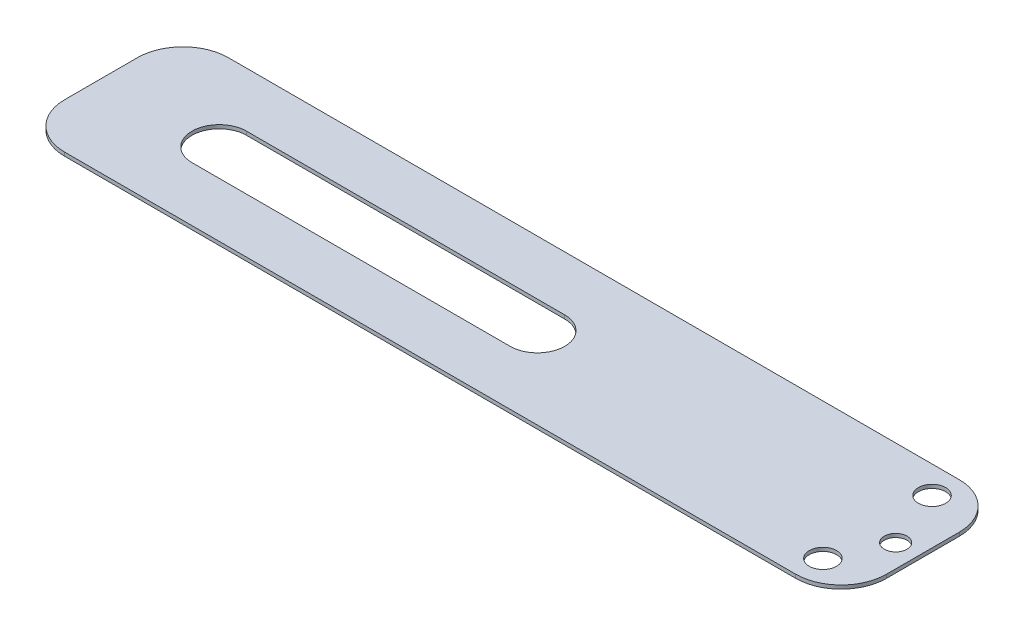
ISO-10303-21;
HEADER;
FILE_DESCRIPTION(('STEP AP214'),'2;1');
FILE_NAME('part.step','',(''),(''),'','','');
FILE_SCHEMA(('AUTOMOTIVE_DESIGN { 1 0 10303 214 1 1 1 1 }'));
ENDSEC;
DATA;
#1=APPLICATION_CONTEXT('core data for automotive mechanical design processes');
#2=APPLICATION_PROTOCOL_DEFINITION('international standard','automotive_design',2000,#1);
#3=PRODUCT_CONTEXT('',#1,'mechanical');
#4=PRODUCT('Part','Part','',(#3));
#5=PRODUCT_RELATED_PRODUCT_CATEGORY('part','',(#4));
#6=PRODUCT_DEFINITION_FORMATION('','',#4);
#7=PRODUCT_DEFINITION_CONTEXT('part definition',#1,'design');
#8=PRODUCT_DEFINITION('design','',#6,#7);
#9=PRODUCT_DEFINITION_SHAPE('','',#8);
#10=(LENGTH_UNIT() NAMED_UNIT(*) SI_UNIT(.MILLI.,.METRE.));
#11=(NAMED_UNIT(*) PLANE_ANGLE_UNIT() SI_UNIT($,.RADIAN.));
#12=(NAMED_UNIT(*) SI_UNIT($,.STERADIAN.) SOLID_ANGLE_UNIT());
#13=UNCERTAINTY_MEASURE_WITH_UNIT(LENGTH_MEASURE(1.E-05),#10,'distance_accuracy_value','');
#14=(GEOMETRIC_REPRESENTATION_CONTEXT(3) GLOBAL_UNCERTAINTY_ASSIGNED_CONTEXT((#13)) GLOBAL_UNIT_ASSIGNED_CONTEXT((#10,
#11,#12)) REPRESENTATION_CONTEXT('',''));
#15=CARTESIAN_POINT('',(0.,0.,0.));
#16=DIRECTION('',(0.,0.,1.));
#17=DIRECTION('',(1.,0.,0.));
#18=AXIS2_PLACEMENT_3D('',#15,#16,#17);
#19=CARTESIAN_POINT('',(-5.,0.4,13.));
#20=DIRECTION('',(0.,-1.,0.));
#21=DIRECTION('',(0.,0.,-1.));
#22=AXIS2_PLACEMENT_3D('',#19,#20,#21);
#23=CYLINDRICAL_SURFACE('',#22,5.);
#24=DIRECTION('',(0.,-1.,0.));
#25=VECTOR('',#24,1.);
#26=CARTESIAN_POINT('',(0.,0.4,13.));
#27=LINE('',#26,#25);
#28=CARTESIAN_POINT('',(0.,0.4,13.));
#29=VERTEX_POINT('',#28);
#30=CARTESIAN_POINT('',(0.,0.,13.));
#31=VERTEX_POINT('',#30);
#32=EDGE_CURVE('E231',#29,#31,#27,.T.);
#33=ORIENTED_EDGE('',*,*,#32,.F.);
#34=CARTESIAN_POINT('',(-5.,0.4,13.));
#35=DIRECTION('',(0.,-1.,0.));
#36=DIRECTION('',(0.,0.,-1.));
#37=AXIS2_PLACEMENT_3D('',#34,#35,#36);
#38=CIRCLE('',#37,5.);
#39=CARTESIAN_POINT('',(-5.00000000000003,0.4,18.));
#40=VERTEX_POINT('',#39);
#41=EDGE_CURVE('E40',#40,#29,#38,.F.);
#42=ORIENTED_EDGE('',*,*,#41,.F.);
#43=DIRECTION('',(0.,-1.,0.));
#44=VECTOR('',#43,1.);
#45=CARTESIAN_POINT('',(-5.,0.4,18.));
#46=LINE('',#45,#44);
#47=CARTESIAN_POINT('',(-5.00000000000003,0.,18.));
#48=VERTEX_POINT('',#47);
#49=EDGE_CURVE('E234',#48,#40,#46,.F.);
#50=ORIENTED_EDGE('',*,*,#49,.F.);
#51=CARTESIAN_POINT('',(-5.,0.,13.));
#52=DIRECTION('',(0.,-1.,0.));
#53=DIRECTION('',(0.,0.,-1.));
#54=AXIS2_PLACEMENT_3D('',#51,#52,#53);
#55=CIRCLE('',#54,5.);
#56=EDGE_CURVE('E11',#31,#48,#55,.T.);
#57=ORIENTED_EDGE('',*,*,#56,.F.);
#58=EDGE_LOOP('',(#33,#42,#50,#57));
#59=FACE_BOUND('',#58,.T.);
#60=ADVANCED_FACE('F33',(#59),#23,.T.);
#61=CARTESIAN_POINT('',(-5.,0.4,5.));
#62=DIRECTION('',(0.,1.,0.));
#63=DIRECTION('',(0.,0.,1.));
#64=AXIS2_PLACEMENT_3D('',#61,#62,#63);
#65=CYLINDRICAL_SURFACE('',#64,5.);
#66=DIRECTION('',(0.,1.,0.));
#67=VECTOR('',#66,1.);
#68=CARTESIAN_POINT('',(0.,0.4,5.));
#69=LINE('',#68,#67);
#70=CARTESIAN_POINT('',(0.,0.,5.));
#71=VERTEX_POINT('',#70);
#72=CARTESIAN_POINT('',(0.,0.4,5.));
#73=VERTEX_POINT('',#72);
#74=EDGE_CURVE('E220',#71,#73,#69,.T.);
#75=ORIENTED_EDGE('',*,*,#74,.F.);
#76=CARTESIAN_POINT('',(-5.,0.,5.));
#77=DIRECTION('',(0.,-1.,0.));
#78=DIRECTION('',(0.,0.,-1.));
#79=AXIS2_PLACEMENT_3D('',#76,#77,#78);
#80=CIRCLE('',#79,5.);
#81=CARTESIAN_POINT('',(-5.00000000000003,0.,0.));
#82=VERTEX_POINT('',#81);
#83=EDGE_CURVE('E226',#82,#71,#80,.T.);
#84=ORIENTED_EDGE('',*,*,#83,.F.);
#85=DIRECTION('',(0.,1.,0.));
#86=VECTOR('',#85,1.);
#87=CARTESIAN_POINT('',(-5.,0.4,0.));
#88=LINE('',#87,#86);
#89=CARTESIAN_POINT('',(-5.00000000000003,0.4,0.));
#90=VERTEX_POINT('',#89);
#91=EDGE_CURVE('E223',#90,#82,#88,.F.);
#92=ORIENTED_EDGE('',*,*,#91,.F.);
#93=CARTESIAN_POINT('',(-5.,0.4,5.));
#94=DIRECTION('',(0.,-1.,0.));
#95=DIRECTION('',(0.,0.,-1.));
#96=AXIS2_PLACEMENT_3D('',#93,#94,#95);
#97=CIRCLE('',#96,5.);
#98=EDGE_CURVE('E229',#73,#90,#97,.F.);
#99=ORIENTED_EDGE('',*,*,#98,.F.);
#100=EDGE_LOOP('',(#75,#84,#92,#99));
#101=FACE_BOUND('',#100,.T.);
#102=ADVANCED_FACE('F244',(#101),#65,.T.);
#103=CARTESIAN_POINT('',(-90.4,0.4,18.));
#104=DIRECTION('',(1.,0.,0.));
#105=DIRECTION('',(0.,0.,-1.));
#106=AXIS2_PLACEMENT_3D('',#103,#104,#105);
#107=PLANE('',#106);
#108=DIRECTION('',(0.,0.,1.));
#109=VECTOR('',#108,1.);
#110=CARTESIAN_POINT('',(-90.4,0.4,18.));
#111=LINE('',#110,#109);
#112=CARTESIAN_POINT('',(-90.4,0.4,5.));
#113=VERTEX_POINT('',#112);
#114=CARTESIAN_POINT('',(-90.4,0.4,13.));
#115=VERTEX_POINT('',#114);
#116=EDGE_CURVE('E181',#113,#115,#111,.T.);
#117=ORIENTED_EDGE('',*,*,#116,.F.);
#118=DIRECTION('',(0.,-1.,0.));
#119=VECTOR('',#118,1.);
#120=CARTESIAN_POINT('',(-90.4,0.4,5.));
#121=LINE('',#120,#119);
#122=CARTESIAN_POINT('',(-90.4,0.,5.));
#123=VERTEX_POINT('',#122);
#124=EDGE_CURVE('E202',#113,#123,#121,.T.);
#125=ORIENTED_EDGE('',*,*,#124,.T.);
#126=DIRECTION('',(0.,0.,1.));
#127=VECTOR('',#126,1.);
#128=CARTESIAN_POINT('',(-90.4,0.,18.));
#129=LINE('',#128,#127);
#130=CARTESIAN_POINT('',(-90.4,0.,13.));
#131=VERTEX_POINT('',#130);
#132=EDGE_CURVE('E178',#123,#131,#129,.T.);
#133=ORIENTED_EDGE('',*,*,#132,.T.);
#134=DIRECTION('',(0.,-1.,0.));
#135=VECTOR('',#134,1.);
#136=CARTESIAN_POINT('',(-90.4,0.4,13.));
#137=LINE('',#136,#135);
#138=EDGE_CURVE('E192',#131,#115,#137,.F.);
#139=ORIENTED_EDGE('',*,*,#138,.T.);
#140=EDGE_LOOP('',(#117,#125,#133,#139));
#141=FACE_BOUND('',#140,.T.);
#142=ADVANCED_FACE('F258',(#141),#107,.F.);
#143=CARTESIAN_POINT('',(-90.4,0.4,18.));
#144=DIRECTION('',(0.,0.,-1.));
#145=DIRECTION('',(-1.,0.,0.));
#146=AXIS2_PLACEMENT_3D('',#143,#144,#145);
#147=PLANE('',#146);
#148=DIRECTION('',(1.,0.,0.));
#149=VECTOR('',#148,1.);
#150=CARTESIAN_POINT('',(-90.4,0.,18.));
#151=LINE('',#150,#149);
#152=CARTESIAN_POINT('',(-85.4,0.,18.));
#153=VERTEX_POINT('',#152);
#154=EDGE_CURVE('E195',#153,#48,#151,.T.);
#155=ORIENTED_EDGE('',*,*,#154,.T.);
#156=ORIENTED_EDGE('',*,*,#49,.T.);
#157=DIRECTION('',(1.,0.,0.));
#158=VECTOR('',#157,1.);
#159=CARTESIAN_POINT('',(-90.4,0.4,18.));
#160=LINE('',#159,#158);
#161=CARTESIAN_POINT('',(-85.4,0.4,18.));
#162=VERTEX_POINT('',#161);
#163=EDGE_CURVE('E184',#162,#40,#160,.T.);
#164=ORIENTED_EDGE('',*,*,#163,.F.);
#165=DIRECTION('',(0.,-1.,0.));
#166=VECTOR('',#165,1.);
#167=CARTESIAN_POINT('',(-85.4,0.4,18.));
#168=LINE('',#167,#166);
#169=EDGE_CURVE('E217',#162,#153,#168,.T.);
#170=ORIENTED_EDGE('',*,*,#169,.T.);
#171=EDGE_LOOP('',(#155,#156,#164,#170));
#172=FACE_BOUND('',#171,.T.);
#173=ADVANCED_FACE('F265',(#172),#147,.F.);
#174=CARTESIAN_POINT('',(0.,0.4,18.));
#175=DIRECTION('',(-1.,0.,0.));
#176=DIRECTION('',(0.,0.,1.));
#177=AXIS2_PLACEMENT_3D('',#174,#175,#176);
#178=PLANE('',#177);
#179=DIRECTION('',(0.,0.,-1.));
#180=VECTOR('',#179,1.);
#181=CARTESIAN_POINT('',(0.,0.4,18.));
#182=LINE('',#181,#180);
#183=EDGE_CURVE('E188',#29,#73,#182,.T.);
#184=ORIENTED_EDGE('',*,*,#183,.F.);
#185=ORIENTED_EDGE('',*,*,#32,.T.);
#186=DIRECTION('',(0.,0.,-1.));
#187=VECTOR('',#186,1.);
#188=CARTESIAN_POINT('',(0.,0.,18.));
#189=LINE('',#188,#187);
#190=EDGE_CURVE('E198',#31,#71,#189,.T.);
#191=ORIENTED_EDGE('',*,*,#190,.T.);
#192=ORIENTED_EDGE('',*,*,#74,.T.);
#193=EDGE_LOOP('',(#184,#185,#191,#192));
#194=FACE_BOUND('',#193,.T.);
#195=ADVANCED_FACE('F241',(#194),#178,.F.);
#196=CARTESIAN_POINT('',(-90.4,0.4,0.));
#197=DIRECTION('',(0.,0.,1.));
#198=DIRECTION('',(1.,0.,0.));
#199=AXIS2_PLACEMENT_3D('',#196,#197,#198);
#200=PLANE('',#199);
#201=DIRECTION('',(-1.,0.,0.));
#202=VECTOR('',#201,1.);
#203=CARTESIAN_POINT('',(-90.4,0.4,0.));
#204=LINE('',#203,#202);
#205=CARTESIAN_POINT('',(-85.4,0.4,0.));
#206=VERTEX_POINT('',#205);
#207=EDGE_CURVE('E190',#90,#206,#204,.T.);
#208=ORIENTED_EDGE('',*,*,#207,.F.);
#209=ORIENTED_EDGE('',*,*,#91,.T.);
#210=DIRECTION('',(-1.,0.,0.));
#211=VECTOR('',#210,1.);
#212=CARTESIAN_POINT('',(-90.4,0.,0.));
#213=LINE('',#212,#211);
#214=CARTESIAN_POINT('',(-85.4,0.,0.));
#215=VERTEX_POINT('',#214);
#216=EDGE_CURVE('E185',#82,#215,#213,.T.);
#217=ORIENTED_EDGE('',*,*,#216,.T.);
#218=DIRECTION('',(0.,-1.,0.));
#219=VECTOR('',#218,1.);
#220=CARTESIAN_POINT('',(-85.4,0.4,0.));
#221=LINE('',#220,#219);
#222=EDGE_CURVE('E210',#215,#206,#221,.F.);
#223=ORIENTED_EDGE('',*,*,#222,.T.);
#224=EDGE_LOOP('',(#208,#209,#217,#223));
#225=FACE_BOUND('',#224,.T.);
#226=ADVANCED_FACE('F251',(#225),#200,.F.);
#227=CARTESIAN_POINT('',(0.,0.4,0.));
#228=DIRECTION('',(0.,-1.,0.));
#229=DIRECTION('',(0.,0.,-1.));
#230=AXIS2_PLACEMENT_3D('',#227,#228,#229);
#231=PLANE('',#230);
#232=DIRECTION('',(1.,0.,0.));
#233=VECTOR('',#232,1.);
#234=CARTESIAN_POINT('',(-77.4,0.4,12.));
#235=LINE('',#234,#233);
#236=CARTESIAN_POINT('',(-77.4,0.4,12.));
#237=VERTEX_POINT('',#236);
#238=CARTESIAN_POINT('',(-42.4,0.4,12.));
#239=VERTEX_POINT('',#238);
#240=EDGE_CURVE('E153',#237,#239,#235,.T.);
#241=ORIENTED_EDGE('',*,*,#240,.F.);
#242=CARTESIAN_POINT('',(-77.4,0.4,9.));
#243=DIRECTION('',(0.,1.,0.));
#244=DIRECTION('',(0.,0.,1.));
#245=AXIS2_PLACEMENT_3D('',#242,#243,#244);
#246=CIRCLE('',#245,3.);
#247=CARTESIAN_POINT('',(-77.4,0.4,6.));
#248=VERTEX_POINT('',#247);
#249=EDGE_CURVE('E126',#248,#237,#246,.T.);
#250=ORIENTED_EDGE('',*,*,#249,.F.);
#251=DIRECTION('',(-1.,0.,0.));
#252=VECTOR('',#251,1.);
#253=CARTESIAN_POINT('',(-77.4,0.4,6.));
#254=LINE('',#253,#252);
#255=CARTESIAN_POINT('',(-42.4,0.4,6.));
#256=VERTEX_POINT('',#255);
#257=EDGE_CURVE('E144',#256,#248,#254,.T.);
#258=ORIENTED_EDGE('',*,*,#257,.F.);
#259=CARTESIAN_POINT('',(-42.4,0.4,9.));
#260=DIRECTION('',(0.,1.,0.));
#261=DIRECTION('',(0.,0.,1.));
#262=AXIS2_PLACEMENT_3D('',#259,#260,#261);
#263=CIRCLE('',#262,3.);
#264=EDGE_CURVE('E147',#239,#256,#263,.T.);
#265=ORIENTED_EDGE('',*,*,#264,.F.);
#266=EDGE_LOOP('',(#241,#250,#258,#265));
#267=FACE_BOUND('',#266,.T.);
#268=CARTESIAN_POINT('',(-2.5,0.4,9.5));
#269=DIRECTION('',(0.,1.,0.));
#270=DIRECTION('',(0.,0.,1.));
#271=AXIS2_PLACEMENT_3D('',#268,#269,#270);
#272=CIRCLE('',#271,1.25);
#273=CARTESIAN_POINT('',(-2.5,0.4,10.75));
#274=VERTEX_POINT('',#273);
#275=EDGE_CURVE('E159',#274,#274,#272,.T.);
#276=ORIENTED_EDGE('',*,*,#275,.F.);
#277=EDGE_LOOP('',(#276));
#278=FACE_BOUND('',#277,.T.);
#279=CARTESIAN_POINT('',(-5.,0.4,15.));
#280=DIRECTION('',(0.,1.,0.));
#281=DIRECTION('',(0.,0.,1.));
#282=AXIS2_PLACEMENT_3D('',#279,#280,#281);
#283=CIRCLE('',#282,1.5);
#284=CARTESIAN_POINT('',(-5.,0.4,16.5));
#285=VERTEX_POINT('',#284);
#286=EDGE_CURVE('E166',#285,#285,#283,.T.);
#287=ORIENTED_EDGE('',*,*,#286,.F.);
#288=EDGE_LOOP('',(#287));
#289=FACE_BOUND('',#288,.T.);
#290=CARTESIAN_POINT('',(-5.,0.4,3.));
#291=DIRECTION('',(0.,1.,0.));
#292=DIRECTION('',(0.,0.,1.));
#293=AXIS2_PLACEMENT_3D('',#290,#291,#292);
#294=CIRCLE('',#293,1.5);
#295=CARTESIAN_POINT('',(-5.,0.4,4.5));
#296=VERTEX_POINT('',#295);
#297=EDGE_CURVE('E172',#296,#296,#294,.T.);
#298=ORIENTED_EDGE('',*,*,#297,.F.);
#299=EDGE_LOOP('',(#298));
#300=FACE_BOUND('',#299,.T.);
#301=ORIENTED_EDGE('',*,*,#163,.T.);
#302=ORIENTED_EDGE('',*,*,#41,.T.);
#303=ORIENTED_EDGE('',*,*,#183,.T.);
#304=ORIENTED_EDGE('',*,*,#98,.T.);
#305=ORIENTED_EDGE('',*,*,#207,.T.);
#306=CARTESIAN_POINT('',(-85.4,0.4,5.));
#307=DIRECTION('',(0.,-1.,0.));
#308=DIRECTION('',(0.,0.,-1.));
#309=AXIS2_PLACEMENT_3D('',#306,#307,#308);
#310=CIRCLE('',#309,5.);
#311=EDGE_CURVE('E215',#206,#113,#310,.F.);
#312=ORIENTED_EDGE('',*,*,#311,.T.);
#313=ORIENTED_EDGE('',*,*,#116,.T.);
#314=CARTESIAN_POINT('',(-85.4,0.4,13.));
#315=DIRECTION('',(0.,-1.,0.));
#316=DIRECTION('',(0.,0.,-1.));
#317=AXIS2_PLACEMENT_3D('',#314,#315,#316);
#318=CIRCLE('',#317,5.);
#319=EDGE_CURVE('E213',#115,#162,#318,.F.);
#320=ORIENTED_EDGE('',*,*,#319,.T.);
#321=EDGE_LOOP('',(#301,#302,#303,#304,#305,#312,#313,#320));
#322=FACE_BOUND('',#321,.T.);
#323=ADVANCED_FACE('F236',(#267,#278,#289,#300,#322),#231,.F.);
#324=CARTESIAN_POINT('',(0.,0.,0.));
#325=DIRECTION('',(0.,-1.,0.));
#326=DIRECTION('',(0.,0.,-1.));
#327=AXIS2_PLACEMENT_3D('',#324,#325,#326);
#328=PLANE('',#327);
#329=CARTESIAN_POINT('',(-77.4,0.,9.));
#330=DIRECTION('',(0.,1.,0.));
#331=DIRECTION('',(0.,0.,1.));
#332=AXIS2_PLACEMENT_3D('',#329,#330,#331);
#333=CIRCLE('',#332,3.);
#334=CARTESIAN_POINT('',(-77.4,0.,6.));
#335=VERTEX_POINT('',#334);
#336=CARTESIAN_POINT('',(-77.4,0.,12.));
#337=VERTEX_POINT('',#336);
#338=EDGE_CURVE('E123',#335,#337,#333,.T.);
#339=ORIENTED_EDGE('',*,*,#338,.T.);
#340=DIRECTION('',(1.,0.,0.));
#341=VECTOR('',#340,1.);
#342=CARTESIAN_POINT('',(-77.4,0.,12.));
#343=LINE('',#342,#341);
#344=CARTESIAN_POINT('',(-42.4,0.,12.));
#345=VERTEX_POINT('',#344);
#346=EDGE_CURVE('E135',#337,#345,#343,.T.);
#347=ORIENTED_EDGE('',*,*,#346,.T.);
#348=CARTESIAN_POINT('',(-42.4,0.,9.));
#349=DIRECTION('',(0.,1.,0.));
#350=DIRECTION('',(0.,0.,1.));
#351=AXIS2_PLACEMENT_3D('',#348,#349,#350);
#352=CIRCLE('',#351,3.);
#353=CARTESIAN_POINT('',(-42.4,0.,6.));
#354=VERTEX_POINT('',#353);
#355=EDGE_CURVE('E139',#345,#354,#352,.T.);
#356=ORIENTED_EDGE('',*,*,#355,.T.);
#357=DIRECTION('',(-1.,0.,0.));
#358=VECTOR('',#357,1.);
#359=CARTESIAN_POINT('',(-77.4,0.,6.));
#360=LINE('',#359,#358);
#361=EDGE_CURVE('E131',#354,#335,#360,.T.);
#362=ORIENTED_EDGE('',*,*,#361,.T.);
#363=EDGE_LOOP('',(#339,#347,#356,#362));
#364=FACE_BOUND('',#363,.T.);
#365=CARTESIAN_POINT('',(-2.5,0.,9.5));
#366=DIRECTION('',(0.,1.,0.));
#367=DIRECTION('',(0.,0.,1.));
#368=AXIS2_PLACEMENT_3D('',#365,#366,#367);
#369=CIRCLE('',#368,1.25);
#370=CARTESIAN_POINT('',(-2.5,0.,10.75));
#371=VERTEX_POINT('',#370);
#372=EDGE_CURVE('E163',#371,#371,#369,.T.);
#373=ORIENTED_EDGE('',*,*,#372,.T.);
#374=EDGE_LOOP('',(#373));
#375=FACE_BOUND('',#374,.T.);
#376=CARTESIAN_POINT('',(-5.,0.,15.));
#377=DIRECTION('',(0.,1.,0.));
#378=DIRECTION('',(0.,0.,1.));
#379=AXIS2_PLACEMENT_3D('',#376,#377,#378);
#380=CIRCLE('',#379,1.5);
#381=CARTESIAN_POINT('',(-5.,0.,16.5));
#382=VERTEX_POINT('',#381);
#383=EDGE_CURVE('E169',#382,#382,#380,.T.);
#384=ORIENTED_EDGE('',*,*,#383,.T.);
#385=EDGE_LOOP('',(#384));
#386=FACE_BOUND('',#385,.T.);
#387=CARTESIAN_POINT('',(-5.,0.,3.));
#388=DIRECTION('',(0.,1.,0.));
#389=DIRECTION('',(0.,0.,1.));
#390=AXIS2_PLACEMENT_3D('',#387,#388,#389);
#391=CIRCLE('',#390,1.5);
#392=CARTESIAN_POINT('',(-5.,0.,4.5));
#393=VERTEX_POINT('',#392);
#394=EDGE_CURVE('E175',#393,#393,#391,.T.);
#395=ORIENTED_EDGE('',*,*,#394,.T.);
#396=EDGE_LOOP('',(#395));
#397=FACE_BOUND('',#396,.T.);
#398=ORIENTED_EDGE('',*,*,#190,.F.);
#399=ORIENTED_EDGE('',*,*,#56,.T.);
#400=ORIENTED_EDGE('',*,*,#154,.F.);
#401=CARTESIAN_POINT('',(-85.4,0.,13.));
#402=DIRECTION('',(0.,-1.,0.));
#403=DIRECTION('',(0.,0.,-1.));
#404=AXIS2_PLACEMENT_3D('',#401,#402,#403);
#405=CIRCLE('',#404,5.);
#406=EDGE_CURVE('E205',#153,#131,#405,.T.);
#407=ORIENTED_EDGE('',*,*,#406,.T.);
#408=ORIENTED_EDGE('',*,*,#132,.F.);
#409=CARTESIAN_POINT('',(-85.4,0.,5.));
#410=DIRECTION('',(0.,-1.,0.));
#411=DIRECTION('',(0.,0.,-1.));
#412=AXIS2_PLACEMENT_3D('',#409,#410,#411);
#413=CIRCLE('',#412,5.);
#414=EDGE_CURVE('E207',#123,#215,#413,.T.);
#415=ORIENTED_EDGE('',*,*,#414,.T.);
#416=ORIENTED_EDGE('',*,*,#216,.F.);
#417=ORIENTED_EDGE('',*,*,#83,.T.);
#418=EDGE_LOOP('',(#398,#399,#400,#407,#408,#415,#416,#417));
#419=FACE_BOUND('',#418,.T.);
#420=ADVANCED_FACE('F141',(#364,#375,#386,#397,#419),#328,.T.);
#421=CARTESIAN_POINT('',(-5.,0.,3.));
#422=DIRECTION('',(0.,1.,0.));
#423=DIRECTION('',(0.,0.,1.));
#424=AXIS2_PLACEMENT_3D('',#421,#422,#423);
#425=CYLINDRICAL_SURFACE('',#424,1.5);
#426=ORIENTED_EDGE('',*,*,#394,.F.);
#427=EDGE_LOOP('',(#426));
#428=FACE_BOUND('',#427,.T.);
#429=ORIENTED_EDGE('',*,*,#297,.T.);
#430=EDGE_LOOP('',(#429));
#431=FACE_BOUND('',#430,.T.);
#432=ADVANCED_FACE('F306',(#428,#431),#425,.F.);
#433=CARTESIAN_POINT('',(-5.,0.,15.));
#434=DIRECTION('',(0.,1.,0.));
#435=DIRECTION('',(0.,0.,1.));
#436=AXIS2_PLACEMENT_3D('',#433,#434,#435);
#437=CYLINDRICAL_SURFACE('',#436,1.5);
#438=ORIENTED_EDGE('',*,*,#383,.F.);
#439=EDGE_LOOP('',(#438));
#440=FACE_BOUND('',#439,.T.);
#441=ORIENTED_EDGE('',*,*,#286,.T.);
#442=EDGE_LOOP('',(#441));
#443=FACE_BOUND('',#442,.T.);
#444=ADVANCED_FACE('F302',(#440,#443),#437,.F.);
#445=CARTESIAN_POINT('',(-2.5,0.,9.5));
#446=DIRECTION('',(0.,1.,0.));
#447=DIRECTION('',(0.,0.,1.));
#448=AXIS2_PLACEMENT_3D('',#445,#446,#447);
#449=CYLINDRICAL_SURFACE('',#448,1.25);
#450=ORIENTED_EDGE('',*,*,#372,.F.);
#451=EDGE_LOOP('',(#450));
#452=FACE_BOUND('',#451,.T.);
#453=ORIENTED_EDGE('',*,*,#275,.T.);
#454=EDGE_LOOP('',(#453));
#455=FACE_BOUND('',#454,.T.);
#456=ADVANCED_FACE('F299',(#452,#455),#449,.F.);
#457=CARTESIAN_POINT('',(-77.4,0.,9.));
#458=DIRECTION('',(0.,1.,0.));
#459=DIRECTION('',(0.,0.,1.));
#460=AXIS2_PLACEMENT_3D('',#457,#458,#459);
#461=CYLINDRICAL_SURFACE('',#460,3.);
#462=ORIENTED_EDGE('',*,*,#249,.T.);
#463=DIRECTION('',(0.,1.,0.));
#464=VECTOR('',#463,1.);
#465=CARTESIAN_POINT('',(-77.4,0.,12.));
#466=LINE('',#465,#464);
#467=EDGE_CURVE('E119',#337,#237,#466,.T.);
#468=ORIENTED_EDGE('',*,*,#467,.F.);
#469=ORIENTED_EDGE('',*,*,#338,.F.);
#470=DIRECTION('',(0.,1.,0.));
#471=VECTOR('',#470,1.);
#472=CARTESIAN_POINT('',(-77.4,0.,6.));
#473=LINE('',#472,#471);
#474=EDGE_CURVE('E157',#335,#248,#473,.T.);
#475=ORIENTED_EDGE('',*,*,#474,.T.);
#476=EDGE_LOOP('',(#462,#468,#469,#475));
#477=FACE_BOUND('',#476,.T.);
#478=ADVANCED_FACE('F121',(#477),#461,.F.);
#479=CARTESIAN_POINT('',(-77.4,0.,6.));
#480=DIRECTION('',(0.,0.,-1.));
#481=DIRECTION('',(-1.,0.,0.));
#482=AXIS2_PLACEMENT_3D('',#479,#480,#481);
#483=PLANE('',#482);
#484=ORIENTED_EDGE('',*,*,#257,.T.);
#485=ORIENTED_EDGE('',*,*,#474,.F.);
#486=ORIENTED_EDGE('',*,*,#361,.F.);
#487=DIRECTION('',(0.,1.,0.));
#488=VECTOR('',#487,1.);
#489=CARTESIAN_POINT('',(-42.4,0.,6.));
#490=LINE('',#489,#488);
#491=EDGE_CURVE('E160',#354,#256,#490,.T.);
#492=ORIENTED_EDGE('',*,*,#491,.T.);
#493=EDGE_LOOP('',(#484,#485,#486,#492));
#494=FACE_BOUND('',#493,.T.);
#495=ADVANCED_FACE('F292',(#494),#483,.F.);
#496=CARTESIAN_POINT('',(-42.4,0.,9.));
#497=DIRECTION('',(0.,1.,0.));
#498=DIRECTION('',(0.,0.,1.));
#499=AXIS2_PLACEMENT_3D('',#496,#497,#498);
#500=CYLINDRICAL_SURFACE('',#499,3.);
#501=ORIENTED_EDGE('',*,*,#264,.T.);
#502=ORIENTED_EDGE('',*,*,#491,.F.);
#503=ORIENTED_EDGE('',*,*,#355,.F.);
#504=DIRECTION('',(0.,1.,0.));
#505=VECTOR('',#504,1.);
#506=CARTESIAN_POINT('',(-42.4,0.,12.));
#507=LINE('',#506,#505);
#508=EDGE_CURVE('E130',#345,#239,#507,.T.);
#509=ORIENTED_EDGE('',*,*,#508,.T.);
#510=EDGE_LOOP('',(#501,#502,#503,#509));
#511=FACE_BOUND('',#510,.T.);
#512=ADVANCED_FACE('F287',(#511),#500,.F.);
#513=CARTESIAN_POINT('',(-77.4,0.,12.));
#514=DIRECTION('',(0.,0.,1.));
#515=DIRECTION('',(1.,0.,0.));
#516=AXIS2_PLACEMENT_3D('',#513,#514,#515);
#517=PLANE('',#516);
#518=ORIENTED_EDGE('',*,*,#240,.T.);
#519=ORIENTED_EDGE('',*,*,#508,.F.);
#520=ORIENTED_EDGE('',*,*,#346,.F.);
#521=ORIENTED_EDGE('',*,*,#467,.T.);
#522=EDGE_LOOP('',(#518,#519,#520,#521));
#523=FACE_BOUND('',#522,.T.);
#524=ADVANCED_FACE('F136',(#523),#517,.F.);
#525=CARTESIAN_POINT('',(-85.4,0.4,5.));
#526=DIRECTION('',(0.,-1.,0.));
#527=DIRECTION('',(0.,0.,-1.));
#528=AXIS2_PLACEMENT_3D('',#525,#526,#527);
#529=CYLINDRICAL_SURFACE('',#528,5.);
#530=ORIENTED_EDGE('',*,*,#311,.F.);
#531=ORIENTED_EDGE('',*,*,#222,.F.);
#532=ORIENTED_EDGE('',*,*,#414,.F.);
#533=ORIENTED_EDGE('',*,*,#124,.F.);
#534=EDGE_LOOP('',(#530,#531,#532,#533));
#535=FACE_BOUND('',#534,.T.);
#536=ADVANCED_FACE('F255',(#535),#529,.T.);
#537=CARTESIAN_POINT('',(-85.4,0.4,13.));
#538=DIRECTION('',(0.,-1.,0.));
#539=DIRECTION('',(0.,0.,-1.));
#540=AXIS2_PLACEMENT_3D('',#537,#538,#539);
#541=CYLINDRICAL_SURFACE('',#540,5.);
#542=ORIENTED_EDGE('',*,*,#319,.F.);
#543=ORIENTED_EDGE('',*,*,#138,.F.);
#544=ORIENTED_EDGE('',*,*,#406,.F.);
#545=ORIENTED_EDGE('',*,*,#169,.F.);
#546=EDGE_LOOP('',(#542,#543,#544,#545));
#547=FACE_BOUND('',#546,.T.);
#548=ADVANCED_FACE('F263',(#547),#541,.T.);
#549=CLOSED_SHELL('',(#60,#102,#142,#173,#195,#226,#323,#420,#432,#444,#456,#478,#495,#512,#524,
#536,#548));
#550=MANIFOLD_SOLID_BREP('B2',#549);
#551=ADVANCED_BREP_SHAPE_REPRESENTATION('',(#18,#550),#14);
#552=SHAPE_DEFINITION_REPRESENTATION(#9,#551);
ENDSEC;
END-ISO-10303-21;
